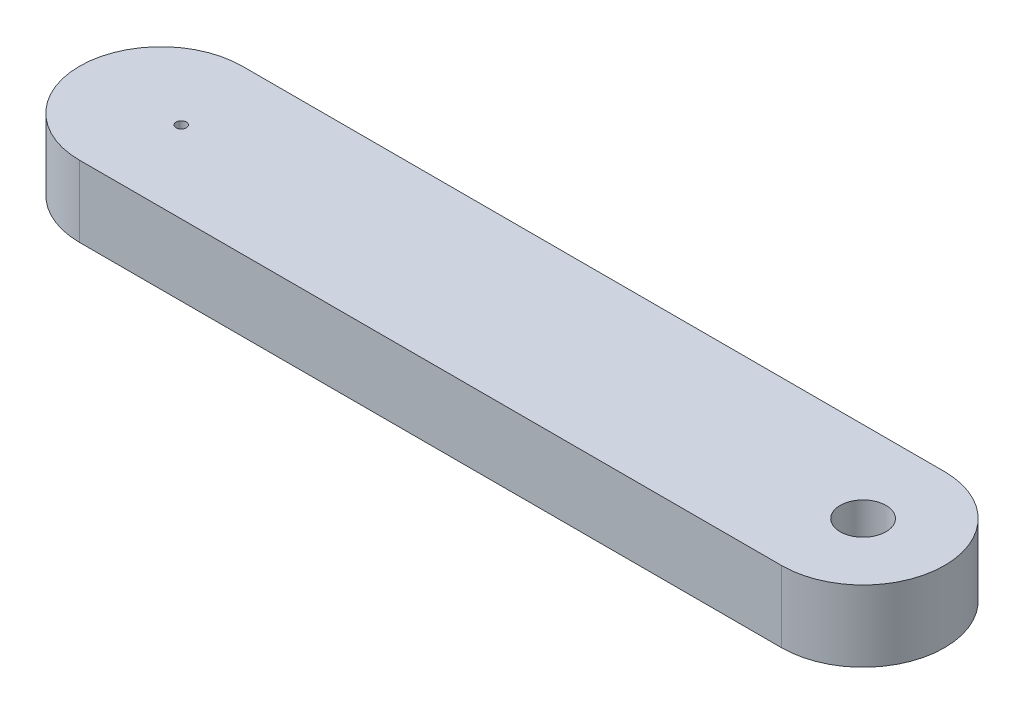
ISO-10303-21;
HEADER;
FILE_DESCRIPTION(('STEP AP214'),'2;1');
FILE_NAME('part.step','',(''),(''),'','','');
FILE_SCHEMA(('AUTOMOTIVE_DESIGN { 1 0 10303 214 1 1 1 1 }'));
ENDSEC;
DATA;
#1=APPLICATION_CONTEXT('core data for automotive mechanical design processes');
#2=APPLICATION_PROTOCOL_DEFINITION('international standard','automotive_design',2000,#1);
#3=PRODUCT_CONTEXT('',#1,'mechanical');
#4=PRODUCT('Part','Part','',(#3));
#5=PRODUCT_RELATED_PRODUCT_CATEGORY('part','',(#4));
#6=PRODUCT_DEFINITION_FORMATION('','',#4);
#7=PRODUCT_DEFINITION_CONTEXT('part definition',#1,'design');
#8=PRODUCT_DEFINITION('design','',#6,#7);
#9=PRODUCT_DEFINITION_SHAPE('','',#8);
#10=(LENGTH_UNIT() NAMED_UNIT(*) SI_UNIT(.MILLI.,.METRE.));
#11=(NAMED_UNIT(*) PLANE_ANGLE_UNIT() SI_UNIT($,.RADIAN.));
#12=(NAMED_UNIT(*) SI_UNIT($,.STERADIAN.) SOLID_ANGLE_UNIT());
#13=UNCERTAINTY_MEASURE_WITH_UNIT(LENGTH_MEASURE(1.E-05),#10,'distance_accuracy_value','');
#14=(GEOMETRIC_REPRESENTATION_CONTEXT(3) GLOBAL_UNCERTAINTY_ASSIGNED_CONTEXT((#13)) GLOBAL_UNIT_ASSIGNED_CONTEXT((#10,
#11,#12)) REPRESENTATION_CONTEXT('',''));
#15=CARTESIAN_POINT('',(0.,0.,0.));
#16=DIRECTION('',(0.,0.,1.));
#17=DIRECTION('',(1.,0.,0.));
#18=AXIS2_PLACEMENT_3D('',#15,#16,#17);
#19=CARTESIAN_POINT('',(-87.63,17.78,0.));
#20=DIRECTION('',(0.,1.,0.));
#21=DIRECTION('',(0.,0.,1.));
#22=AXIS2_PLACEMENT_3D('',#19,#20,#21);
#23=PLANE('',#22);
#24=CARTESIAN_POINT('',(-82.55,17.78,0.));
#25=DIRECTION('',(0.,1.,0.));
#26=DIRECTION('',(0.,0.,1.));
#27=AXIS2_PLACEMENT_3D('',#24,#25,#26);
#28=CIRCLE('',#27,1.26999999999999);
#29=CARTESIAN_POINT('',(-82.55,17.78,1.26999999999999));
#30=VERTEX_POINT('',#29);
#31=EDGE_CURVE('E100',#30,#30,#28,.T.);
#32=ORIENTED_EDGE('',*,*,#31,.F.);
#33=EDGE_LOOP('',(#32));
#34=FACE_BOUND('',#33,.T.);
#35=CARTESIAN_POINT('',(-87.63,17.78,0.));
#36=DIRECTION('',(0.,1.,0.));
#37=DIRECTION('',(0.,0.,1.));
#38=AXIS2_PLACEMENT_3D('',#35,#36,#37);
#39=CIRCLE('',#38,20.32);
#40=CARTESIAN_POINT('',(-87.63,17.78,-20.32));
#41=VERTEX_POINT('',#40);
#42=CARTESIAN_POINT('',(-87.63,17.78,20.32));
#43=VERTEX_POINT('',#42);
#44=EDGE_CURVE('E85',#41,#43,#39,.T.);
#45=ORIENTED_EDGE('',*,*,#44,.T.);
#46=DIRECTION('',(1.,0.,0.));
#47=VECTOR('',#46,1.);
#48=CARTESIAN_POINT('',(-87.63,17.78,20.32));
#49=LINE('',#48,#47);
#50=CARTESIAN_POINT('',(87.63,17.78,20.32));
#51=VERTEX_POINT('',#50);
#52=EDGE_CURVE('E80',#43,#51,#49,.T.);
#53=ORIENTED_EDGE('',*,*,#52,.T.);
#54=CARTESIAN_POINT('',(87.63,17.78,0.));
#55=DIRECTION('',(0.,1.,0.));
#56=DIRECTION('',(0.,0.,1.));
#57=AXIS2_PLACEMENT_3D('',#54,#55,#56);
#58=CIRCLE('',#57,20.32);
#59=CARTESIAN_POINT('',(87.63,17.78,-20.32));
#60=VERTEX_POINT('',#59);
#61=EDGE_CURVE('E83',#51,#60,#58,.T.);
#62=ORIENTED_EDGE('',*,*,#61,.T.);
#63=DIRECTION('',(-1.,0.,0.));
#64=VECTOR('',#63,1.);
#65=CARTESIAN_POINT('',(-87.63,17.78,-20.32));
#66=LINE('',#65,#64);
#67=EDGE_CURVE('E50',#60,#41,#66,.T.);
#68=ORIENTED_EDGE('',*,*,#67,.T.);
#69=EDGE_LOOP('',(#45,#53,#62,#68));
#70=FACE_BOUND('',#69,.T.);
#71=CARTESIAN_POINT('',(87.63,17.78,0.));
#72=DIRECTION('',(0.,1.,0.));
#73=DIRECTION('',(0.,0.,1.));
#74=AXIS2_PLACEMENT_3D('',#71,#72,#73);
#75=CIRCLE('',#74,5.71499999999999);
#76=CARTESIAN_POINT('',(87.63,17.78,5.71499999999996));
#77=VERTEX_POINT('',#76);
#78=EDGE_CURVE('E115',#77,#77,#75,.T.);
#79=ORIENTED_EDGE('',*,*,#78,.F.);
#80=EDGE_LOOP('',(#79));
#81=FACE_BOUND('',#80,.T.);
#82=ADVANCED_FACE('F33',(#34,#70,#81),#23,.T.);
#83=CARTESIAN_POINT('',(-87.63,0.,0.));
#84=DIRECTION('',(0.,1.,0.));
#85=DIRECTION('',(0.,0.,1.));
#86=AXIS2_PLACEMENT_3D('',#83,#84,#85);
#87=PLANE('',#86);
#88=CARTESIAN_POINT('',(-87.63,0.,0.));
#89=DIRECTION('',(0.,1.,0.));
#90=DIRECTION('',(0.,0.,1.));
#91=AXIS2_PLACEMENT_3D('',#88,#89,#90);
#92=CIRCLE('',#91,20.32);
#93=CARTESIAN_POINT('',(-87.63,0.,-20.32));
#94=VERTEX_POINT('',#93);
#95=CARTESIAN_POINT('',(-87.63,0.,20.32));
#96=VERTEX_POINT('',#95);
#97=EDGE_CURVE('E97',#94,#96,#92,.T.);
#98=ORIENTED_EDGE('',*,*,#97,.F.);
#99=DIRECTION('',(-1.,0.,0.));
#100=VECTOR('',#99,1.);
#101=CARTESIAN_POINT('',(-87.63,0.,-20.32));
#102=LINE('',#101,#100);
#103=CARTESIAN_POINT('',(87.63,0.,-20.32));
#104=VERTEX_POINT('',#103);
#105=EDGE_CURVE('E73',#104,#94,#102,.T.);
#106=ORIENTED_EDGE('',*,*,#105,.F.);
#107=CARTESIAN_POINT('',(87.63,0.,0.));
#108=DIRECTION('',(0.,1.,0.));
#109=DIRECTION('',(0.,0.,1.));
#110=AXIS2_PLACEMENT_3D('',#107,#108,#109);
#111=CIRCLE('',#110,20.32);
#112=CARTESIAN_POINT('',(87.63,0.,20.32));
#113=VERTEX_POINT('',#112);
#114=EDGE_CURVE('E67',#113,#104,#111,.T.);
#115=ORIENTED_EDGE('',*,*,#114,.F.);
#116=DIRECTION('',(1.,0.,0.));
#117=VECTOR('',#116,1.);
#118=CARTESIAN_POINT('',(-87.63,0.,20.32));
#119=LINE('',#118,#117);
#120=EDGE_CURVE('E89',#96,#113,#119,.T.);
#121=ORIENTED_EDGE('',*,*,#120,.F.);
#122=EDGE_LOOP('',(#98,#106,#115,#121));
#123=FACE_BOUND('',#122,.T.);
#124=CARTESIAN_POINT('',(-82.55,0.,0.));
#125=DIRECTION('',(0.,1.,0.));
#126=DIRECTION('',(0.,0.,1.));
#127=AXIS2_PLACEMENT_3D('',#124,#125,#126);
#128=CIRCLE('',#127,1.26999999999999);
#129=CARTESIAN_POINT('',(-82.55,0.,1.26999999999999));
#130=VERTEX_POINT('',#129);
#131=EDGE_CURVE('E112',#130,#130,#128,.T.);
#132=ORIENTED_EDGE('',*,*,#131,.T.);
#133=EDGE_LOOP('',(#132));
#134=FACE_BOUND('',#133,.T.);
#135=CARTESIAN_POINT('',(87.63,0.,0.));
#136=DIRECTION('',(0.,1.,0.));
#137=DIRECTION('',(0.,0.,1.));
#138=AXIS2_PLACEMENT_3D('',#135,#136,#137);
#139=CIRCLE('',#138,5.71499999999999);
#140=CARTESIAN_POINT('',(87.63,0.,5.71499999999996));
#141=VERTEX_POINT('',#140);
#142=EDGE_CURVE('E118',#141,#141,#139,.T.);
#143=ORIENTED_EDGE('',*,*,#142,.T.);
#144=EDGE_LOOP('',(#143));
#145=FACE_BOUND('',#144,.T.);
#146=ADVANCED_FACE('F108',(#123,#134,#145),#87,.F.);
#147=CARTESIAN_POINT('',(-87.63,17.78,0.));
#148=DIRECTION('',(0.,-1.,0.));
#149=DIRECTION('',(0.,0.,-1.));
#150=AXIS2_PLACEMENT_3D('',#147,#148,#149);
#151=CYLINDRICAL_SURFACE('',#150,20.32);
#152=ORIENTED_EDGE('',*,*,#97,.T.);
#153=DIRECTION('',(0.,-1.,0.));
#154=VECTOR('',#153,1.);
#155=CARTESIAN_POINT('',(-87.63,17.78,20.32));
#156=LINE('',#155,#154);
#157=EDGE_CURVE('E11',#43,#96,#156,.T.);
#158=ORIENTED_EDGE('',*,*,#157,.F.);
#159=ORIENTED_EDGE('',*,*,#44,.F.);
#160=DIRECTION('',(0.,-1.,0.));
#161=VECTOR('',#160,1.);
#162=CARTESIAN_POINT('',(-87.63,17.78,-20.32));
#163=LINE('',#162,#161);
#164=EDGE_CURVE('E93',#41,#94,#163,.T.);
#165=ORIENTED_EDGE('',*,*,#164,.T.);
#166=EDGE_LOOP('',(#152,#158,#159,#165));
#167=FACE_BOUND('',#166,.T.);
#168=ADVANCED_FACE('F35',(#167),#151,.T.);
#169=CARTESIAN_POINT('',(-87.63,17.78,20.32));
#170=DIRECTION('',(0.,0.,-1.));
#171=DIRECTION('',(-1.,0.,0.));
#172=AXIS2_PLACEMENT_3D('',#169,#170,#171);
#173=PLANE('',#172);
#174=ORIENTED_EDGE('',*,*,#120,.T.);
#175=DIRECTION('',(0.,-1.,0.));
#176=VECTOR('',#175,1.);
#177=CARTESIAN_POINT('',(87.63,17.78,20.32));
#178=LINE('',#177,#176);
#179=EDGE_CURVE('E42',#51,#113,#178,.T.);
#180=ORIENTED_EDGE('',*,*,#179,.F.);
#181=ORIENTED_EDGE('',*,*,#52,.F.);
#182=ORIENTED_EDGE('',*,*,#157,.T.);
#183=EDGE_LOOP('',(#174,#180,#181,#182));
#184=FACE_BOUND('',#183,.T.);
#185=ADVANCED_FACE('F88',(#184),#173,.F.);
#186=CARTESIAN_POINT('',(87.63,17.78,0.));
#187=DIRECTION('',(0.,-1.,0.));
#188=DIRECTION('',(0.,0.,-1.));
#189=AXIS2_PLACEMENT_3D('',#186,#187,#188);
#190=CYLINDRICAL_SURFACE('',#189,20.32);
#191=ORIENTED_EDGE('',*,*,#114,.T.);
#192=DIRECTION('',(0.,-1.,0.));
#193=VECTOR('',#192,1.);
#194=CARTESIAN_POINT('',(87.63,17.78,-20.32));
#195=LINE('',#194,#193);
#196=EDGE_CURVE('E90',#60,#104,#195,.T.);
#197=ORIENTED_EDGE('',*,*,#196,.F.);
#198=ORIENTED_EDGE('',*,*,#61,.F.);
#199=ORIENTED_EDGE('',*,*,#179,.T.);
#200=EDGE_LOOP('',(#191,#197,#198,#199));
#201=FACE_BOUND('',#200,.T.);
#202=ADVANCED_FACE('F91',(#201),#190,.T.);
#203=CARTESIAN_POINT('',(-87.63,17.78,-20.32));
#204=DIRECTION('',(0.,0.,1.));
#205=DIRECTION('',(1.,0.,0.));
#206=AXIS2_PLACEMENT_3D('',#203,#204,#205);
#207=PLANE('',#206);
#208=ORIENTED_EDGE('',*,*,#105,.T.);
#209=ORIENTED_EDGE('',*,*,#164,.F.);
#210=ORIENTED_EDGE('',*,*,#67,.F.);
#211=ORIENTED_EDGE('',*,*,#196,.T.);
#212=EDGE_LOOP('',(#208,#209,#210,#211));
#213=FACE_BOUND('',#212,.T.);
#214=ADVANCED_FACE('F105',(#213),#207,.F.);
#215=CARTESIAN_POINT('',(-82.55,17.78,0.));
#216=DIRECTION('',(0.,-1.,0.));
#217=DIRECTION('',(0.,0.,-1.));
#218=AXIS2_PLACEMENT_3D('',#215,#216,#217);
#219=CYLINDRICAL_SURFACE('',#218,1.26999999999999);
#220=ORIENTED_EDGE('',*,*,#31,.T.);
#221=EDGE_LOOP('',(#220));
#222=FACE_BOUND('',#221,.T.);
#223=ORIENTED_EDGE('',*,*,#131,.F.);
#224=EDGE_LOOP('',(#223));
#225=FACE_BOUND('',#224,.T.);
#226=ADVANCED_FACE('F135',(#222,#225),#219,.F.);
#227=CARTESIAN_POINT('',(87.63,17.78,0.));
#228=DIRECTION('',(0.,-1.,0.));
#229=DIRECTION('',(0.,0.,-1.));
#230=AXIS2_PLACEMENT_3D('',#227,#228,#229);
#231=CYLINDRICAL_SURFACE('',#230,5.71499999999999);
#232=ORIENTED_EDGE('',*,*,#78,.T.);
#233=EDGE_LOOP('',(#232));
#234=FACE_BOUND('',#233,.T.);
#235=ORIENTED_EDGE('',*,*,#142,.F.);
#236=EDGE_LOOP('',(#235));
#237=FACE_BOUND('',#236,.T.);
#238=ADVANCED_FACE('F124',(#234,#237),#231,.F.);
#239=CLOSED_SHELL('',(#82,#146,#168,#185,#202,#214,#226,#238));
#240=MANIFOLD_SOLID_BREP('B2',#239);
#241=ADVANCED_BREP_SHAPE_REPRESENTATION('',(#18,#240),#14);
#242=SHAPE_DEFINITION_REPRESENTATION(#9,#241);
ENDSEC;
END-ISO-10303-21;
